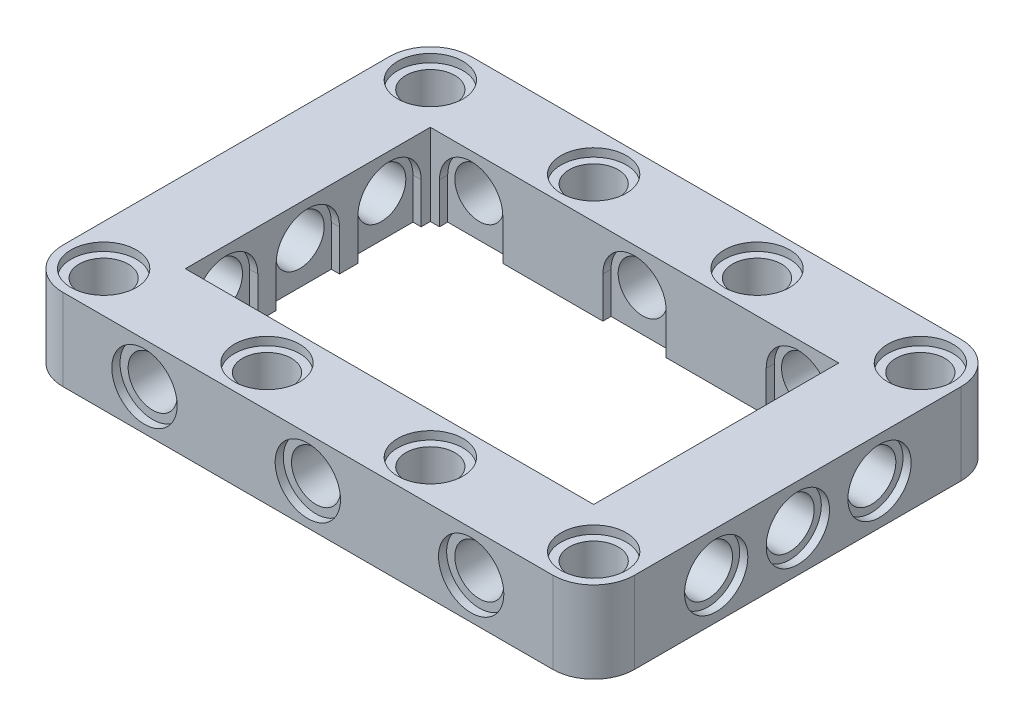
from build123d import *

# Parameters (mm, degrees)
BOSS_EXTRUDE1_DEPTH       = 8
SKETCH2_R                 = 2.4
CUT_EXTRUDE1_DEPTH        = 64.749509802
SKETCH2_5_R               = 3.2
SKETCH2_5_R_2             = 2.4
CUT_EXTRUDE2_DEPTH        = 0.8
SKETCH3_R                 = 2.4
CUT_EXTRUDE3_DEPTH        = 68.052218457
SKETCH3_3_R               = 3.1
SKETCH3_3_R_2             = 2.4
CUT_EXTRUDE4_DEPTH        = 0.8
LPATTERN2_COUNT           = 3
LPATTERN2_PITCH           = 16
SKETCH4_R                 = 2.4
CUT_EXTRUDE5_DEPTH        = 67.090846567
SKETCH4_3_R               = 3.2
SKETCH4_3_R_2             = 2.4
CUT_EXTRUDE6_DEPTH        = 0.8
CUT_EXTRUDE8_START        = -0.8
CUT_EXTRUDE8_DEPTH        = 0.8
CUT_EXTRUDE9_DEPTH        = 0.8
LPATTERN4_COUNT           = 3
LPATTERN4_PITCH           = 16
LPATTERN5_COUNT           = 3
LPATTERN5_PITCH           = 8
MIRROR1_COPY_1_SKETCH_R   = 2.4
MIRROR1_COPY_1_DEPTH      = 68.052218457
MIRROR1_COPY_2_SKETCH_R   = 2.4
MIRROR1_COPY_2_DEPTH      = 68.052218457
MIRROR1_COPY_3_SKETCH_R   = 3.1
MIRROR1_COPY_3_SKETCH_R_2 = 2.4
MIRROR1_COPY_3_DEPTH      = 0.8
MIRROR1_COPY_4_SKETCH_R   = 3.1
MIRROR1_COPY_4_SKETCH_R_2 = 2.4
MIRROR1_COPY_4_DEPTH      = 0.8
MIRROR1_START             = -0.8
MIRROR1_COPY_5_DEPTH      = 0.8
MIRROR1_COPY_6_DEPTH      = 0.8
MIRROR1_COPY_7_SKETCH_R   = 2.4
MIRROR1_COPY_7_DEPTH      = 68.052218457
MIRROR2_COPY_1_SKETCH_R   = 2.4
MIRROR2_COPY_1_DEPTH      = 67.090846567
MIRROR2_COPY_2_SKETCH_R   = 2.4
MIRROR2_COPY_2_DEPTH      = 67.090846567
MIRROR2_COPY_3_SKETCH_R   = 3.2
MIRROR2_COPY_3_SKETCH_R_2 = 2.4
MIRROR2_COPY_3_DEPTH      = 0.8
MIRROR2_COPY_4_SKETCH_R   = 3.2
MIRROR2_COPY_4_SKETCH_R_2 = 2.4
MIRROR2_COPY_4_DEPTH      = 0.8
MIRROR2_COPY_5_DEPTH      = 0.8
MIRROR2_COPY_6_DEPTH      = 0.8
MIRROR2_COPY_7_SKETCH_R   = 2.4
MIRROR2_COPY_7_DEPTH      = 67.090846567
MIRROR3_COPY_1_SKETCH_R   = 2.4
MIRROR3_COPY_1_DEPTH      = 64.749509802
MIRROR3_COPY_2_SKETCH_R   = 2.4
MIRROR3_COPY_2_DEPTH      = 64.749509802
MIRROR3_COPY_3_SKETCH_R   = 3.2
MIRROR3_COPY_3_SKETCH_R_2 = 2.4
MIRROR3_COPY_3_DEPTH      = 0.8
MIRROR3_COPY_4_SKETCH_R   = 3.2
MIRROR3_COPY_4_SKETCH_R_2 = 2.4
MIRROR3_COPY_4_DEPTH      = 0.8
MIRROR3_COPY_5_SKETCH_R   = 2.4
MIRROR3_COPY_5_DEPTH      = 64.749509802


with BuildPart() as part:
    # Sketch1 → Boss-Extrude1 (new body)
    with BuildSketch(Plane(origin=(0, 0, 0), x_dir=(1, 0, 0), z_dir=(0, 1, 0))):
        with BuildLine():
            ThreePointArc((-4, 0), (-2.828427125, 2.828427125), (0, 4))
            Line((0, 4), (4, 4))
            Line((4, 4), (4, 28))
            Line((4, 28), (0, 28))
            ThreePointArc((0, 28), (-2.828427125, 29.171572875), (-4, 32))
            Line((-4, 32), (-4, 0))
        make_face()
        with BuildLine():
            Line((4, 32), (4, 28))
            Line((4, 28), (44, 28))
            Line((44, 28), (44, 32))
            ThreePointArc((44, 32), (45.171572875, 34.828427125), (48, 36))
            Line((48, 36), (0, 36))
            ThreePointArc((0, 36), (2.828427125, 34.828427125), (4, 32))
        make_face()
        with BuildLine():
            Line((44, 28), (44, 4))
            Line((44, 4), (48, 4))
            ThreePointArc((48, 4), (50.828427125, 2.828427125), (52, 0))
            Line((52, 0), (52, 32))
            ThreePointArc((52, 32), (50.828427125, 29.171572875), (48, 28))
            Line((48, 28), (44, 28))
        make_face()
        with BuildLine():
            Line((44, 4), (4, 4))
            Line((4, 4), (4, 0))
            ThreePointArc((4, 0), (2.828427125, -2.828427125), (0, -4))
            Line((0, -4), (48, -4))
            ThreePointArc((48, -4), (45.171572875, -2.828427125), (44, 0))
            Line((44, 0), (44, 4))
        make_face()
        with BuildLine():
            Line((48, 4), (44, 4))
            Line((44, 4), (44, 0))
            ThreePointArc((44, 0), (45.171572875, -2.828427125), (48, -4))
            ThreePointArc((48, -4), (50.828427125, -2.828427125), (52, 0))
            ThreePointArc((52, 0), (50.828427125, 2.828427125), (48, 4))
        make_face()
        with BuildLine():
            Line((4, 4), (0, 4))
            ThreePointArc((0, 4), (-2.828427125, 2.828427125), (-4, 0))
            ThreePointArc((-4, 0), (-2.828427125, -2.828427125), (0, -4))
            ThreePointArc((0, -4), (2.828427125, -2.828427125), (4, 0))
            Line((4, 0), (4, 4))
        make_face()
        with BuildLine():
            Line((0, 28), (4, 28))
            Line((4, 28), (4, 32))
            ThreePointArc((4, 32), (2.828427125, 34.828427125), (0, 36))
            ThreePointArc((0, 36), (-2.828427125, 34.828427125), (-4, 32))
            ThreePointArc((-4, 32), (-2.828427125, 29.171572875), (0, 28))
        make_face()
        with BuildLine():
            Line((44, 32), (44, 28))
            Line((44, 28), (48, 28))
            ThreePointArc((48, 28), (50.828427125, 29.171572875), (52, 32))
            ThreePointArc((52, 32), (50.828427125, 34.828427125), (48, 36))
            ThreePointArc((48, 36), (45.171572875, 34.828427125), (44, 32))
        make_face()
    extrude(amount=BOSS_EXTRUDE1_DEPTH)

    # Sketch2 → Cut-Extrude1 (cut, through all)
    with BuildSketch(Plane(origin=(0, 8, 0), x_dir=(1, 0, 0), z_dir=(0, 1, 0))):
        with Locations(Location((0, 0, 0), (0, 0, 270))):
            Circle(SKETCH2_R)
        with Locations(Location((0, 32, 0), (0, 0, 270))):
            Circle(SKETCH2_R)
        with Locations(Location((48, 32, 0), (0, 0, 270))):
            Circle(SKETCH2_R)
        with Locations(Location((48, 0, 0), (0, 0, 270))):
            Circle(SKETCH2_R)
    cut_extrude1 = extrude(amount=-CUT_EXTRUDE1_DEPTH, mode=Mode.SUBTRACT)

    # Sketch2_5 → Cut-Extrude2 (cut)
    # profile 1 of 4: a face of its own
    with BuildSketch(Plane(origin=(0, 8, 0), x_dir=(1, 0, 0), z_dir=(0, 1, 0))):
        with Locations(Location((48, 32, 0), (0, 0, 270))):
            Circle(SKETCH2_5_R)
        with Locations(Location((48, 32, 0), (0, 0, 270))):
            Circle(SKETCH2_5_R_2, mode=Mode.SUBTRACT)
    # profile 2 of 4: a face of its own
    with BuildSketch(Plane(origin=(0, 8, 0), x_dir=(1, 0, 0), z_dir=(0, 1, 0))):
        with Locations(Location((48, 0, 0), (0, 0, 270))):
            Circle(SKETCH2_5_R)
        with Locations(Location((48, 0, 0), (0, 0, 270))):
            Circle(SKETCH2_5_R_2, mode=Mode.SUBTRACT)
    # profile 3 of 4: a face of its own
    with BuildSketch(Plane(origin=(0, 8, 0), x_dir=(1, 0, 0), z_dir=(0, 1, 0))):
        with Locations(Location((0, 0, 0), (0, 0, 270))):
            Circle(SKETCH2_5_R)
        with Locations(Location((0, 0, 0), (0, 0, 270))):
            Circle(SKETCH2_5_R_2, mode=Mode.SUBTRACT)
    # profile 4 of 4: a face of its own
    with BuildSketch(Plane(origin=(0, 8, 0), x_dir=(1, 0, 0), z_dir=(0, 1, 0))):
        with Locations(Location((0, 32, 0), (0, 0, 270))):
            Circle(SKETCH2_5_R)
        with Locations(Location((0, 32, 0), (0, 0, 270))):
            Circle(SKETCH2_5_R_2, mode=Mode.SUBTRACT)
    cut_extrude2 = extrude(amount=-CUT_EXTRUDE2_DEPTH, mode=Mode.SUBTRACT)

    # Sketch3 → Cut-Extrude3 (cut, through all)
    with BuildSketch(Plane(origin=(52, 0, 0), x_dir=(0, 0, -1), z_dir=(1, 0, 0))):
        with Locations((8, 4)):
            Circle(SKETCH3_R)
    cut_extrude3 = extrude(amount=-CUT_EXTRUDE3_DEPTH, mode=Mode.SUBTRACT)

    # Sketch3_3 → Cut-Extrude4 (cut)
    with BuildSketch(Plane(origin=(52, 0, 0), x_dir=(0, 0, -1), z_dir=(1, 0, 0))):
        with Locations((8, 4)):
            Circle(SKETCH3_3_R)
        with Locations((8, 4)):
            Circle(SKETCH3_3_R_2, mode=Mode.SUBTRACT)
    cut_extrude4 = extrude(amount=-CUT_EXTRUDE4_DEPTH, mode=Mode.SUBTRACT)

    # LPattern2: Cut-Extrude1, Cut-Extrude2 ×3
    with Locations(*[(i * LPATTERN2_PITCH, 0, 0) for i in range(1, LPATTERN2_COUNT)]):
        add(cut_extrude1, mode=Mode.SUBTRACT)
        add(cut_extrude2, mode=Mode.SUBTRACT)

    # Sketch4 → Cut-Extrude5 (cut, through all)
    with BuildSketch(Plane.XY.offset(4)):
        with Locations((8, 4)):
            Circle(SKETCH4_R)
    cut_extrude5 = extrude(amount=-CUT_EXTRUDE5_DEPTH, mode=Mode.SUBTRACT)

    # Sketch4_3 → Cut-Extrude6 (cut)
    with BuildSketch(Plane.XY.offset(4)):
        with Locations((8, 4)):
            Circle(SKETCH4_3_R)
        with Locations((8, 4)):
            Circle(SKETCH4_3_R_2, mode=Mode.SUBTRACT)
    cut_extrude6 = extrude(amount=-CUT_EXTRUDE6_DEPTH, mode=Mode.SUBTRACT)

    # Sketch7 → Cut-Extrude8 (cut)
    with BuildSketch(Plane.ZY.offset(-44).offset(CUT_EXTRUDE8_START)):
        with BuildLine():
            Line((-4.9, 4), (-4.9, -2.807583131))
            ThreePointArc((-4.9, -2.807583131), (-8, -5.907583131), (-11.1, -2.807583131))
            Line((-11.1, -2.807583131), (-11.1, 4))
            ThreePointArc((-11.1, 4), (-8, 7.1), (-4.9, 4))
        make_face()
    cut_extrude8 = extrude(amount=CUT_EXTRUDE8_DEPTH, mode=Mode.SUBTRACT)

    # Sketch9 → Cut-Extrude9 (cut)
    with BuildSketch(Plane(origin=(0, 0, -4), x_dir=(-1, 0, 0), z_dir=(0, 0, -1))):
        with BuildLine():
            Line((-4.9, 4), (-4.9, -2.086171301))
            ThreePointArc((-4.9, -2.086171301), (-8, -5.186171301), (-11.1, -2.086171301))
            Line((-11.1, -2.086171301), (-11.1, 4))
            ThreePointArc((-11.1, 4), (-8, 7.1), (-4.9, 4))
        make_face()
    cut_extrude9 = extrude(amount=-CUT_EXTRUDE9_DEPTH, mode=Mode.SUBTRACT)

    # LPattern4: Cut-Extrude5, Cut-Extrude6, Cut-Extrude9 ×3
    with Locations(*[(i * LPATTERN4_PITCH, 0, 0) for i in range(1, LPATTERN4_COUNT)]):
        add(cut_extrude5, mode=Mode.SUBTRACT)
        add(cut_extrude6, mode=Mode.SUBTRACT)
        add(cut_extrude9, mode=Mode.SUBTRACT)

    # LPattern5: Cut-Extrude3, Cut-Extrude4, Cut-Extrude8 ×3
    with Locations(*[(0, 0, -i * LPATTERN5_PITCH) for i in range(1, LPATTERN5_COUNT)]):
        add(cut_extrude3, mode=Mode.SUBTRACT)
        add(cut_extrude4, mode=Mode.SUBTRACT)
        add(cut_extrude8, mode=Mode.SUBTRACT)

    # Mirror1: Cut-Extrude4, Cut-Extrude8 across plane
    add(cut_extrude4.mirror(Plane.ZY.offset(-24)), mode=Mode.SUBTRACT)
    add(cut_extrude8.mirror(Plane.ZY.offset(-24)), mode=Mode.SUBTRACT)

    # Mirror1 copy 1 sketch → Mirror1 copy 1 (cut, through all)
    with BuildSketch(Plane(origin=(-4, 0, -8), x_dir=(0, 0, -1), z_dir=(-1, 0, 0))):
        with Locations((8, -4)):
            Circle(MIRROR1_COPY_1_SKETCH_R)
    extrude(amount=-MIRROR1_COPY_1_DEPTH, mode=Mode.SUBTRACT)

    # Mirror1 copy 2 sketch → Mirror1 copy 2 (cut, through all)
    with BuildSketch(Plane(origin=(-4, 0, -16), x_dir=(0, 0, -1), z_dir=(-1, 0, 0))):
        with Locations((8, -4)):
            Circle(MIRROR1_COPY_2_SKETCH_R)
    extrude(amount=-MIRROR1_COPY_2_DEPTH, mode=Mode.SUBTRACT)

    # Mirror1 copy 3 sketch → Mirror1 copy 3 (cut)
    with BuildSketch(Plane(origin=(-4, 0, -8), x_dir=(0, 0, -1), z_dir=(-1, 0, 0))):
        with Locations((8, -4)):
            Circle(MIRROR1_COPY_3_SKETCH_R)
        with Locations((8, -4)):
            Circle(MIRROR1_COPY_3_SKETCH_R_2, mode=Mode.SUBTRACT)
    extrude(amount=-MIRROR1_COPY_3_DEPTH, mode=Mode.SUBTRACT)

    # Mirror1 copy 4 sketch → Mirror1 copy 4 (cut)
    with BuildSketch(Plane(origin=(-4, 0, -16), x_dir=(0, 0, -1), z_dir=(-1, 0, 0))):
        with Locations((8, -4)):
            Circle(MIRROR1_COPY_4_SKETCH_R)
        with Locations((8, -4)):
            Circle(MIRROR1_COPY_4_SKETCH_R_2, mode=Mode.SUBTRACT)
    extrude(amount=-MIRROR1_COPY_4_DEPTH, mode=Mode.SUBTRACT)

    # Mirror1 copy 5 sketch → Mirror1 copy 5 (cut)
    with BuildSketch(Plane(origin=(4, 0, -8), x_dir=(0, 0, 1), z_dir=(1, 0, 0)).offset(MIRROR1_START)):
        with BuildLine():
            Line((-4.9, -4), (-4.9, 2.807583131))
            ThreePointArc((-4.9, 2.807583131), (-8, 5.907583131), (-11.1, 2.807583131))
            Line((-11.1, 2.807583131), (-11.1, -4))
            ThreePointArc((-11.1, -4), (-8, -7.1), (-4.9, -4))
        make_face()
    extrude(amount=MIRROR1_COPY_5_DEPTH, mode=Mode.SUBTRACT)

    # Mirror1 copy 6 sketch → Mirror1 copy 6 (cut)
    with BuildSketch(Plane(origin=(4, 0, -16), x_dir=(0, 0, 1), z_dir=(1, 0, 0)).offset(MIRROR1_START)):
        with BuildLine():
            Line((-4.9, -4), (-4.9, 2.807583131))
            ThreePointArc((-4.9, 2.807583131), (-8, 5.907583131), (-11.1, 2.807583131))
            Line((-11.1, 2.807583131), (-11.1, -4))
            ThreePointArc((-11.1, -4), (-8, -7.1), (-4.9, -4))
        make_face()
    extrude(amount=MIRROR1_COPY_6_DEPTH, mode=Mode.SUBTRACT)

    # Mirror1 copy 7 sketch → Mirror1 copy 7 (cut, through all)
    with BuildSketch(Plane(origin=(-4, 0, 0), x_dir=(0, 0, -1), z_dir=(-1, 0, 0))):
        with Locations((8, -4)):
            Circle(MIRROR1_COPY_7_SKETCH_R)
    extrude(amount=-MIRROR1_COPY_7_DEPTH, mode=Mode.SUBTRACT)

    # Mirror2: Cut-Extrude6, Cut-Extrude9 across plane
    add(cut_extrude6.mirror(Plane.XY.offset(-16)), mode=Mode.SUBTRACT)
    add(cut_extrude9.mirror(Plane.XY.offset(-16)), mode=Mode.SUBTRACT)

    # Mirror2 copy 1 sketch → Mirror2 copy 1 (cut, through all)
    with BuildSketch(Plane(origin=(16, 0, -36), x_dir=(1, 0, 0), z_dir=(0, 0, -1))):
        with Locations((8, -4)):
            Circle(MIRROR2_COPY_1_SKETCH_R)
    extrude(amount=-MIRROR2_COPY_1_DEPTH, mode=Mode.SUBTRACT)

    # Mirror2 copy 2 sketch → Mirror2 copy 2 (cut, through all)
    with BuildSketch(Plane(origin=(32, 0, -36), x_dir=(1, 0, 0), z_dir=(0, 0, -1))):
        with Locations((8, -4)):
            Circle(MIRROR2_COPY_2_SKETCH_R)
    extrude(amount=-MIRROR2_COPY_2_DEPTH, mode=Mode.SUBTRACT)

    # Mirror2 copy 3 sketch → Mirror2 copy 3 (cut)
    with BuildSketch(Plane(origin=(16, 0, -36), x_dir=(1, 0, 0), z_dir=(0, 0, -1))):
        with Locations((8, -4)):
            Circle(MIRROR2_COPY_3_SKETCH_R)
        with Locations((8, -4)):
            Circle(MIRROR2_COPY_3_SKETCH_R_2, mode=Mode.SUBTRACT)
    extrude(amount=-MIRROR2_COPY_3_DEPTH, mode=Mode.SUBTRACT)

    # Mirror2 copy 4 sketch → Mirror2 copy 4 (cut)
    with BuildSketch(Plane(origin=(32, 0, -36), x_dir=(1, 0, 0), z_dir=(0, 0, -1))):
        with Locations((8, -4)):
            Circle(MIRROR2_COPY_4_SKETCH_R)
        with Locations((8, -4)):
            Circle(MIRROR2_COPY_4_SKETCH_R_2, mode=Mode.SUBTRACT)
    extrude(amount=-MIRROR2_COPY_4_DEPTH, mode=Mode.SUBTRACT)

    # Mirror2 copy 5 sketch → Mirror2 copy 5 (cut)
    with BuildSketch(Plane(origin=(16, 0, -28), x_dir=(-1, 0, 0), z_dir=(0, 0, 1))):
        with BuildLine():
            Line((-4.9, -4), (-4.9, 2.086171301))
            ThreePointArc((-4.9, 2.086171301), (-8, 5.186171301), (-11.1, 2.086171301))
            Line((-11.1, 2.086171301), (-11.1, -4))
            ThreePointArc((-11.1, -4), (-8, -7.1), (-4.9, -4))
        make_face()
    extrude(amount=-MIRROR2_COPY_5_DEPTH, mode=Mode.SUBTRACT)

    # Mirror2 copy 6 sketch → Mirror2 copy 6 (cut)
    with BuildSketch(Plane(origin=(32, 0, -28), x_dir=(-1, 0, 0), z_dir=(0, 0, 1))):
        with BuildLine():
            Line((-4.9, -4), (-4.9, 2.086171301))
            ThreePointArc((-4.9, 2.086171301), (-8, 5.186171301), (-11.1, 2.086171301))
            Line((-11.1, 2.086171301), (-11.1, -4))
            ThreePointArc((-11.1, -4), (-8, -7.1), (-4.9, -4))
        make_face()
    extrude(amount=-MIRROR2_COPY_6_DEPTH, mode=Mode.SUBTRACT)

    # Mirror2 copy 7 sketch → Mirror2 copy 7 (cut, through all)
    with BuildSketch(Plane(origin=(0, 0, -36), x_dir=(1, 0, 0), z_dir=(0, 0, -1))):
        with Locations((8, -4)):
            Circle(MIRROR2_COPY_7_SKETCH_R)
    extrude(amount=-MIRROR2_COPY_7_DEPTH, mode=Mode.SUBTRACT)

    # Mirror3: Cut-Extrude2 across plane
    add(cut_extrude2.mirror(Plane.ZX.offset(4)), mode=Mode.SUBTRACT)

    # Mirror3 copy 1 sketch → Mirror3 copy 1 (cut, through all)
    with BuildSketch(Plane(origin=(16, 0, 0), x_dir=(1, 0, 0), z_dir=(0, -1, 0))):
        Circle(MIRROR3_COPY_1_SKETCH_R)
        with Locations((0, -32)):
            Circle(MIRROR3_COPY_1_SKETCH_R)
        with Locations((48, -32)):
            Circle(MIRROR3_COPY_1_SKETCH_R)
        with Locations((48, 0)):
            Circle(MIRROR3_COPY_1_SKETCH_R)
    extrude(amount=-MIRROR3_COPY_1_DEPTH, mode=Mode.SUBTRACT)

    # Mirror3 copy 2 sketch → Mirror3 copy 2 (cut, through all)
    with BuildSketch(Plane(origin=(32, 0, 0), x_dir=(1, 0, 0), z_dir=(0, -1, 0))):
        Circle(MIRROR3_COPY_2_SKETCH_R)
        with Locations((0, -32)):
            Circle(MIRROR3_COPY_2_SKETCH_R)
        with Locations((48, -32)):
            Circle(MIRROR3_COPY_2_SKETCH_R)
        with Locations((48, 0)):
            Circle(MIRROR3_COPY_2_SKETCH_R)
    extrude(amount=-MIRROR3_COPY_2_DEPTH, mode=Mode.SUBTRACT)

    # Mirror3 copy 3 sketch → Mirror3 copy 3 (cut)
    # profile 1 of 4: a face of its own
    with BuildSketch(Plane(origin=(16, 0, 0), x_dir=(1, 0, 0), z_dir=(0, -1, 0))):
        with Locations((48, -32)):
            Circle(MIRROR3_COPY_3_SKETCH_R)
        with Locations((48, -32)):
            Circle(MIRROR3_COPY_3_SKETCH_R_2, mode=Mode.SUBTRACT)
    # profile 2 of 4: a face of its own
    with BuildSketch(Plane(origin=(16, 0, 0), x_dir=(1, 0, 0), z_dir=(0, -1, 0))):
        with Locations((48, 0)):
            Circle(MIRROR3_COPY_3_SKETCH_R)
        with Locations((48, 0)):
            Circle(MIRROR3_COPY_3_SKETCH_R_2, mode=Mode.SUBTRACT)
    # profile 3 of 4: a face of its own
    with BuildSketch(Plane(origin=(16, 0, 0), x_dir=(1, 0, 0), z_dir=(0, -1, 0))):
        Circle(MIRROR3_COPY_3_SKETCH_R)
        Circle(MIRROR3_COPY_3_SKETCH_R_2, mode=Mode.SUBTRACT)
    # profile 4 of 4: a face of its own
    with BuildSketch(Plane(origin=(16, 0, 0), x_dir=(1, 0, 0), z_dir=(0, -1, 0))):
        with Locations((0, -32)):
            Circle(MIRROR3_COPY_3_SKETCH_R)
        with Locations((0, -32)):
            Circle(MIRROR3_COPY_3_SKETCH_R_2, mode=Mode.SUBTRACT)
    extrude(amount=-MIRROR3_COPY_3_DEPTH, mode=Mode.SUBTRACT)

    # Mirror3 copy 4 sketch → Mirror3 copy 4 (cut)
    # profile 1 of 4: a face of its own
    with BuildSketch(Plane(origin=(32, 0, 0), x_dir=(1, 0, 0), z_dir=(0, -1, 0))):
        with Locations((48, -32)):
            Circle(MIRROR3_COPY_4_SKETCH_R)
        with Locations((48, -32)):
            Circle(MIRROR3_COPY_4_SKETCH_R_2, mode=Mode.SUBTRACT)
    # profile 2 of 4: a face of its own
    with BuildSketch(Plane(origin=(32, 0, 0), x_dir=(1, 0, 0), z_dir=(0, -1, 0))):
        with Locations((48, 0)):
            Circle(MIRROR3_COPY_4_SKETCH_R)
        with Locations((48, 0)):
            Circle(MIRROR3_COPY_4_SKETCH_R_2, mode=Mode.SUBTRACT)
    # profile 3 of 4: a face of its own
    with BuildSketch(Plane(origin=(32, 0, 0), x_dir=(1, 0, 0), z_dir=(0, -1, 0))):
        Circle(MIRROR3_COPY_4_SKETCH_R)
        Circle(MIRROR3_COPY_4_SKETCH_R_2, mode=Mode.SUBTRACT)
    # profile 4 of 4: a face of its own
    with BuildSketch(Plane(origin=(32, 0, 0), x_dir=(1, 0, 0), z_dir=(0, -1, 0))):
        with Locations((0, -32)):
            Circle(MIRROR3_COPY_4_SKETCH_R)
        with Locations((0, -32)):
            Circle(MIRROR3_COPY_4_SKETCH_R_2, mode=Mode.SUBTRACT)
    extrude(amount=-MIRROR3_COPY_4_DEPTH, mode=Mode.SUBTRACT)

    # Mirror3 copy 5 sketch → Mirror3 copy 5 (cut, through all)
    with BuildSketch(Plane.XZ):
        Circle(MIRROR3_COPY_5_SKETCH_R)
        with Locations((0, -32)):
            Circle(MIRROR3_COPY_5_SKETCH_R)
        with Locations((48, -32)):
            Circle(MIRROR3_COPY_5_SKETCH_R)
        with Locations((48, 0)):
            Circle(MIRROR3_COPY_5_SKETCH_R)
    extrude(amount=-MIRROR3_COPY_5_DEPTH, mode=Mode.SUBTRACT)


solid = part.part
